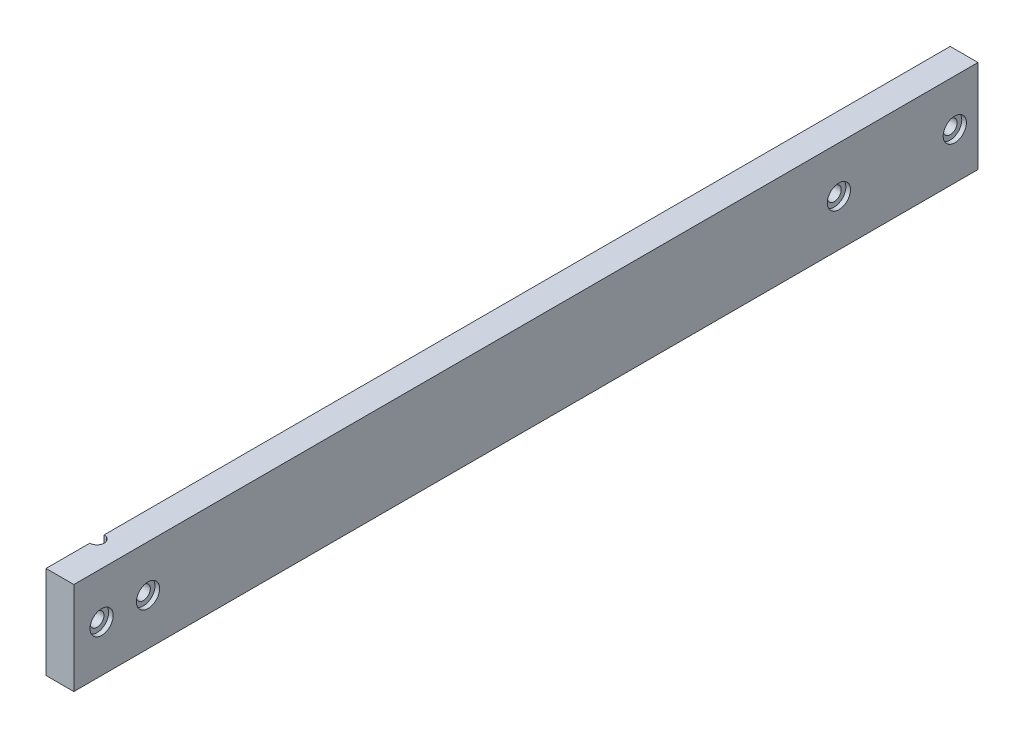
from build123d import *

# Parameters (mm, degrees)
ESQUISSE1_W             = 195
ESQUISSE1_H             = 20
ESQUISSE1_R             = 1.5
EXTRUSION1_DEPTH        = 6
ESQUISSE2_R             = 2.5
ENL_V_MAT_EXTRU_1_DEPTH = 1
ENL_V_MAT_EXTRU_2_DEPTH = 197.11476232


with BuildPart() as part:
    # Esquisse1 → Extrusion1 (new body)
    with BuildSketch(Plane(origin=(0, 0, 0), x_dir=(0, 0, -1), z_dir=(1, 0, 0))):
        with Locations((97.5, 10)):
            Rectangle(ESQUISSE1_W, ESQUISSE1_H)
        with Locations((6, 10)):
            Circle(ESQUISSE1_R, mode=Mode.SUBTRACT)
        with Locations((16, 10)):
            Circle(ESQUISSE1_R, mode=Mode.SUBTRACT)
        with Locations((165, 10)):
            Circle(ESQUISSE1_R, mode=Mode.SUBTRACT)
        with Locations((190, 10)):
            Circle(ESQUISSE1_R, mode=Mode.SUBTRACT)
    extrude(amount=EXTRUSION1_DEPTH)

    # Esquisse2 → Enl_v. mat.-Extru.1 (cut)
    with BuildSketch(Plane(origin=(6, 0, 0), x_dir=(0, 0, -1), z_dir=(1, 0, 0))):
        with Locations((6, 10)):
            Circle(ESQUISSE2_R)
        with Locations((16, 10)):
            Circle(ESQUISSE2_R)
        with Locations((165, 10)):
            Circle(ESQUISSE2_R)
        with Locations((190, 10)):
            Circle(ESQUISSE2_R)
    extrude(amount=-ENL_V_MAT_EXTRU_1_DEPTH, mode=Mode.SUBTRACT)

    # Esquisse3 → Enl_v. mat.-Extru.2 (cut, through all)
    with BuildSketch(Plane.XZ):
        with BuildLine():
            Line((0, -9.45), (0, -12.55))
            ThreePointArc((0, -12.55), (1.55, -11), (0, -9.45))
        make_face()
    extrude(amount=-ENL_V_MAT_EXTRU_2_DEPTH, mode=Mode.SUBTRACT)


solid = part.part
